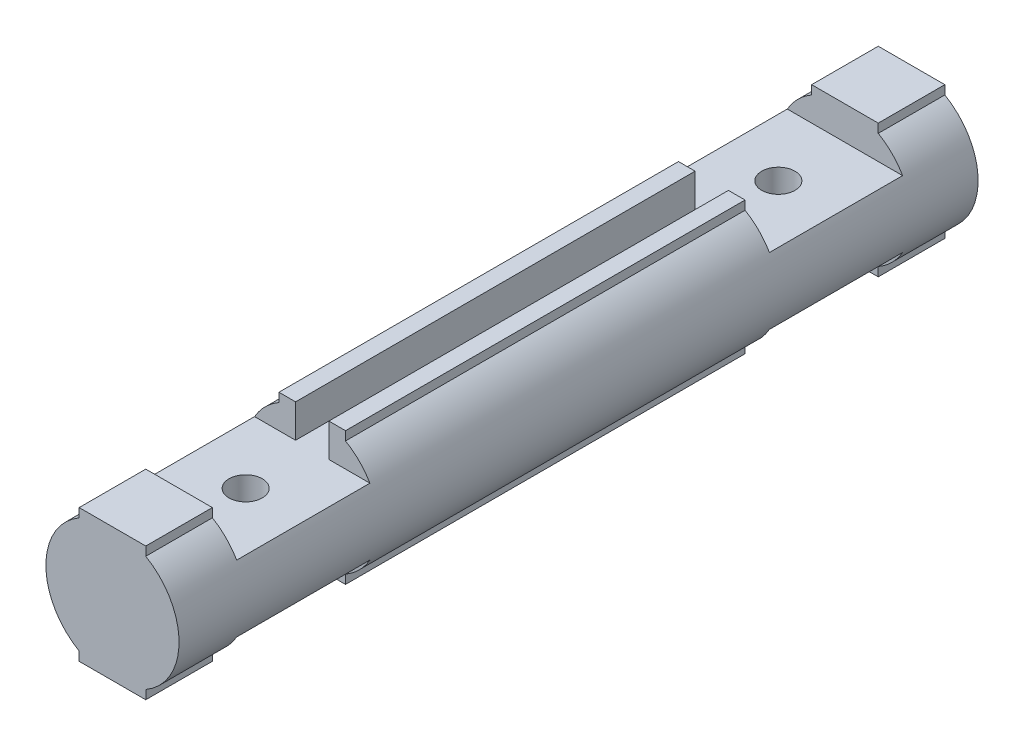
ISO-10303-21;
HEADER;
FILE_DESCRIPTION(('STEP AP214'),'2;1');
FILE_NAME('part.step','',(''),(''),'','','');
FILE_SCHEMA(('AUTOMOTIVE_DESIGN { 1 0 10303 214 1 1 1 1 }'));
ENDSEC;
DATA;
#1=APPLICATION_CONTEXT('core data for automotive mechanical design processes');
#2=APPLICATION_PROTOCOL_DEFINITION('international standard','automotive_design',2000,#1);
#3=PRODUCT_CONTEXT('',#1,'mechanical');
#4=PRODUCT('Part','Part','',(#3));
#5=PRODUCT_RELATED_PRODUCT_CATEGORY('part','',(#4));
#6=PRODUCT_DEFINITION_FORMATION('','',#4);
#7=PRODUCT_DEFINITION_CONTEXT('part definition',#1,'design');
#8=PRODUCT_DEFINITION('design','',#6,#7);
#9=PRODUCT_DEFINITION_SHAPE('','',#8);
#10=(LENGTH_UNIT() NAMED_UNIT(*) SI_UNIT(.MILLI.,.METRE.));
#11=(NAMED_UNIT(*) PLANE_ANGLE_UNIT() SI_UNIT($,.RADIAN.));
#12=(NAMED_UNIT(*) SI_UNIT($,.STERADIAN.) SOLID_ANGLE_UNIT());
#13=UNCERTAINTY_MEASURE_WITH_UNIT(LENGTH_MEASURE(1.E-05),#10,'distance_accuracy_value','');
#14=(GEOMETRIC_REPRESENTATION_CONTEXT(3) GLOBAL_UNCERTAINTY_ASSIGNED_CONTEXT((#13)) GLOBAL_UNIT_ASSIGNED_CONTEXT((#10,
#11,#12)) REPRESENTATION_CONTEXT('',''));
#15=CARTESIAN_POINT('',(0.,0.,0.));
#16=DIRECTION('',(0.,0.,1.));
#17=DIRECTION('',(1.,0.,0.));
#18=AXIS2_PLACEMENT_3D('',#15,#16,#17);
#19=CARTESIAN_POINT('',(5.,-10.,-82.3606797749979));
#20=DIRECTION('',(0.,-1.,0.));
#21=DIRECTION('',(0.,0.,-1.));
#22=AXIS2_PLACEMENT_3D('',#19,#20,#21);
#23=PLANE('',#22);
#24=DIRECTION('',(-1.,0.,0.));
#25=VECTOR('',#24,1.);
#26=CARTESIAN_POINT('',(8.66025403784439,-10.,-30.));
#27=LINE('',#26,#25);
#28=CARTESIAN_POINT('',(-2.5,-10.,-30.));
#29=VERTEX_POINT('',#28);
#30=CARTESIAN_POINT('',(-5.,-10.,-30.));
#31=VERTEX_POINT('',#30);
#32=EDGE_CURVE('E321',#29,#31,#27,.T.);
#33=ORIENTED_EDGE('',*,*,#32,.F.);
#34=DIRECTION('',(0.,0.,1.));
#35=VECTOR('',#34,1.);
#36=CARTESIAN_POINT('',(-2.5,-10.,30.));
#37=LINE('',#36,#35);
#38=CARTESIAN_POINT('',(-2.5,-10.,30.));
#39=VERTEX_POINT('',#38);
#40=EDGE_CURVE('E681',#29,#39,#37,.T.);
#41=ORIENTED_EDGE('',*,*,#40,.T.);
#42=DIRECTION('',(-1.,0.,0.));
#43=VECTOR('',#42,1.);
#44=CARTESIAN_POINT('',(8.66025403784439,-10.,30.));
#45=LINE('',#44,#43);
#46=CARTESIAN_POINT('',(-5.,-10.,30.));
#47=VERTEX_POINT('',#46);
#48=EDGE_CURVE('E536',#39,#47,#45,.T.);
#49=ORIENTED_EDGE('',*,*,#48,.T.);
#50=DIRECTION('',(0.,0.,1.));
#51=VECTOR('',#50,1.);
#52=CARTESIAN_POINT('',(-5.,-10.,-82.3606797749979));
#53=LINE('',#52,#51);
#54=EDGE_CURVE('E483',#31,#47,#53,.T.);
#55=ORIENTED_EDGE('',*,*,#54,.F.);
#56=EDGE_LOOP('',(#33,#41,#49,#55));
#57=FACE_BOUND('',#56,.T.);
#58=ADVANCED_FACE('F33',(#57),#23,.T.);
#59=CARTESIAN_POINT('',(5.,-10.,30.));
#60=VERTEX_POINT('',#59);
#61=CARTESIAN_POINT('',(2.5,-10.,30.));
#62=VERTEX_POINT('',#61);
#63=EDGE_CURVE('E568',#60,#62,#45,.T.);
#64=ORIENTED_EDGE('',*,*,#63,.T.);
#65=DIRECTION('',(0.,0.,-1.));
#66=VECTOR('',#65,1.);
#67=CARTESIAN_POINT('',(2.5,-10.,30.));
#68=LINE('',#67,#66);
#69=CARTESIAN_POINT('',(2.5,-10.,-30.));
#70=VERTEX_POINT('',#69);
#71=EDGE_CURVE('E308',#62,#70,#68,.T.);
#72=ORIENTED_EDGE('',*,*,#71,.T.);
#73=CARTESIAN_POINT('',(5.,-10.,-30.));
#74=VERTEX_POINT('',#73);
#75=EDGE_CURVE('E307',#74,#70,#27,.T.);
#76=ORIENTED_EDGE('',*,*,#75,.F.);
#77=DIRECTION('',(0.,0.,1.));
#78=VECTOR('',#77,1.);
#79=CARTESIAN_POINT('',(5.,-10.,-82.3606797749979));
#80=LINE('',#79,#78);
#81=EDGE_CURVE('E478',#74,#60,#80,.T.);
#82=ORIENTED_EDGE('',*,*,#81,.T.);
#83=EDGE_LOOP('',(#64,#72,#76,#82));
#84=FACE_BOUND('',#83,.T.);
#85=ADVANCED_FACE('F567',(#84),#23,.T.);
#86=CARTESIAN_POINT('',(0.,0.,-30.));
#87=DIRECTION('',(0.,0.,1.));
#88=DIRECTION('',(1.,0.,0.));
#89=AXIS2_PLACEMENT_3D('',#86,#87,#88);
#90=PLANE('',#89);
#91=DIRECTION('',(0.,-1.,0.));
#92=VECTOR('',#91,1.);
#93=CARTESIAN_POINT('',(-2.5,65.2079728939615,-30.));
#94=LINE('',#93,#92);
#95=CARTESIAN_POINT('',(-2.5,-5.,-30.));
#96=VERTEX_POINT('',#95);
#97=EDGE_CURVE('E683',#96,#29,#94,.T.);
#98=ORIENTED_EDGE('',*,*,#97,.T.);
#99=ORIENTED_EDGE('',*,*,#32,.T.);
#100=DIRECTION('',(0.,1.,0.));
#101=VECTOR('',#100,1.);
#102=CARTESIAN_POINT('',(-5.,-10.,-30.));
#103=LINE('',#102,#101);
#104=CARTESIAN_POINT('',(-5.,-8.66025403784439,-30.));
#105=VERTEX_POINT('',#104);
#106=EDGE_CURVE('E522',#31,#105,#103,.T.);
#107=ORIENTED_EDGE('',*,*,#106,.T.);
#108=CARTESIAN_POINT('',(0.,0.,-30.));
#109=DIRECTION('',(0.,0.,1.));
#110=DIRECTION('',(1.,0.,0.));
#111=AXIS2_PLACEMENT_3D('',#108,#109,#110);
#112=CIRCLE('',#111,10.);
#113=CARTESIAN_POINT('',(-8.66025403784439,-5.,-30.));
#114=VERTEX_POINT('',#113);
#115=EDGE_CURVE('E331',#114,#105,#112,.T.);
#116=ORIENTED_EDGE('',*,*,#115,.F.);
#117=DIRECTION('',(1.,0.,0.));
#118=VECTOR('',#117,1.);
#119=CARTESIAN_POINT('',(8.66025403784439,-5.,-30.));
#120=LINE('',#119,#118);
#121=EDGE_CURVE('E317',#114,#96,#120,.T.);
#122=ORIENTED_EDGE('',*,*,#121,.T.);
#123=EDGE_LOOP('',(#98,#99,#107,#116,#122));
#124=FACE_BOUND('',#123,.T.);
#125=ADVANCED_FACE('F671',(#124),#90,.F.);
#126=DIRECTION('',(0.,-1.,0.));
#127=VECTOR('',#126,1.);
#128=CARTESIAN_POINT('',(2.5,65.2079728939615,-30.));
#129=LINE('',#128,#127);
#130=CARTESIAN_POINT('',(2.5,-4.99999999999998,-30.));
#131=VERTEX_POINT('',#130);
#132=EDGE_CURVE('E292',#131,#70,#129,.T.);
#133=ORIENTED_EDGE('',*,*,#132,.F.);
#134=CARTESIAN_POINT('',(8.66025403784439,-5.,-30.));
#135=VERTEX_POINT('',#134);
#136=EDGE_CURVE('E304',#131,#135,#120,.T.);
#137=ORIENTED_EDGE('',*,*,#136,.T.);
#138=CARTESIAN_POINT('',(0.,0.,-30.));
#139=DIRECTION('',(0.,0.,1.));
#140=DIRECTION('',(1.,0.,0.));
#141=AXIS2_PLACEMENT_3D('',#138,#139,#140);
#142=CIRCLE('',#141,10.);
#143=CARTESIAN_POINT('',(5.,-8.66025403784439,-30.));
#144=VERTEX_POINT('',#143);
#145=EDGE_CURVE('E336',#144,#135,#142,.T.);
#146=ORIENTED_EDGE('',*,*,#145,.F.);
#147=DIRECTION('',(0.,-1.,0.));
#148=VECTOR('',#147,1.);
#149=CARTESIAN_POINT('',(5.,-10.,-30.));
#150=LINE('',#149,#148);
#151=EDGE_CURVE('E334',#144,#74,#150,.T.);
#152=ORIENTED_EDGE('',*,*,#151,.T.);
#153=ORIENTED_EDGE('',*,*,#75,.T.);
#154=EDGE_LOOP('',(#133,#137,#146,#152,#153));
#155=FACE_BOUND('',#154,.T.);
#156=ADVANCED_FACE('F302',(#155),#90,.F.);
#157=CARTESIAN_POINT('',(0.,0.,30.));
#158=DIRECTION('',(0.,0.,-1.));
#159=DIRECTION('',(1.,0.,0.));
#160=AXIS2_PLACEMENT_3D('',#157,#158,#159);
#161=PLANE('',#160);
#162=DIRECTION('',(0.,-1.,0.));
#163=VECTOR('',#162,1.);
#164=CARTESIAN_POINT('',(-2.5,65.2079728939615,30.));
#165=LINE('',#164,#163);
#166=CARTESIAN_POINT('',(-2.5,-4.99999999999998,30.));
#167=VERTEX_POINT('',#166);
#168=EDGE_CURVE('E679',#167,#39,#165,.T.);
#169=ORIENTED_EDGE('',*,*,#168,.F.);
#170=DIRECTION('',(1.,0.,0.));
#171=VECTOR('',#170,1.);
#172=CARTESIAN_POINT('',(8.66025403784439,-5.,30.));
#173=LINE('',#172,#171);
#174=CARTESIAN_POINT('',(-8.66025403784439,-5.,30.));
#175=VERTEX_POINT('',#174);
#176=EDGE_CURVE('E674',#175,#167,#173,.T.);
#177=ORIENTED_EDGE('',*,*,#176,.F.);
#178=CARTESIAN_POINT('',(0.,0.,30.));
#179=DIRECTION('',(0.,0.,-1.));
#180=DIRECTION('',(-1.,0.,0.));
#181=AXIS2_PLACEMENT_3D('',#178,#179,#180);
#182=CIRCLE('',#181,10.);
#183=CARTESIAN_POINT('',(-5.,-8.66025403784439,30.));
#184=VERTEX_POINT('',#183);
#185=EDGE_CURVE('E56',#184,#175,#182,.T.);
#186=ORIENTED_EDGE('',*,*,#185,.F.);
#187=DIRECTION('',(0.,-1.,0.));
#188=VECTOR('',#187,1.);
#189=CARTESIAN_POINT('',(-5.,-10.,30.));
#190=LINE('',#189,#188);
#191=EDGE_CURVE('E41',#184,#47,#190,.T.);
#192=ORIENTED_EDGE('',*,*,#191,.T.);
#193=ORIENTED_EDGE('',*,*,#48,.F.);
#194=EDGE_LOOP('',(#169,#177,#186,#192,#193));
#195=FACE_BOUND('',#194,.T.);
#196=ADVANCED_FACE('F535',(#195),#161,.F.);
#197=DIRECTION('',(0.,-1.,0.));
#198=VECTOR('',#197,1.);
#199=CARTESIAN_POINT('',(2.5,65.2079728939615,30.));
#200=LINE('',#199,#198);
#201=CARTESIAN_POINT('',(2.5,-5.,30.));
#202=VERTEX_POINT('',#201);
#203=EDGE_CURVE('E48',#202,#62,#200,.T.);
#204=ORIENTED_EDGE('',*,*,#203,.T.);
#205=ORIENTED_EDGE('',*,*,#63,.F.);
#206=DIRECTION('',(0.,1.,0.));
#207=VECTOR('',#206,1.);
#208=CARTESIAN_POINT('',(5.,-10.,30.));
#209=LINE('',#208,#207);
#210=CARTESIAN_POINT('',(5.,-8.66025403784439,30.));
#211=VERTEX_POINT('',#210);
#212=EDGE_CURVE('E574',#60,#211,#209,.T.);
#213=ORIENTED_EDGE('',*,*,#212,.T.);
#214=CARTESIAN_POINT('',(0.,0.,30.));
#215=DIRECTION('',(0.,0.,-1.));
#216=DIRECTION('',(-1.,0.,0.));
#217=AXIS2_PLACEMENT_3D('',#214,#215,#216);
#218=CIRCLE('',#217,10.);
#219=CARTESIAN_POINT('',(8.66025403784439,-5.,30.));
#220=VERTEX_POINT('',#219);
#221=EDGE_CURVE('E578',#220,#211,#218,.T.);
#222=ORIENTED_EDGE('',*,*,#221,.F.);
#223=EDGE_CURVE('E297',#202,#220,#173,.T.);
#224=ORIENTED_EDGE('',*,*,#223,.F.);
#225=EDGE_LOOP('',(#204,#205,#213,#222,#224));
#226=FACE_BOUND('',#225,.T.);
#227=ADVANCED_FACE('F696',(#226),#161,.F.);
#228=CARTESIAN_POINT('',(0.,0.,60.));
#229=DIRECTION('',(0.,0.,-1.));
#230=DIRECTION('',(-1.,0.,0.));
#231=AXIS2_PLACEMENT_3D('',#228,#229,#230);
#232=CYLINDRICAL_SURFACE('',#231,10.);
#233=CARTESIAN_POINT('',(0.,0.,50.));
#234=DIRECTION('',(0.,0.,-1.));
#235=DIRECTION('',(-1.,0.,0.));
#236=AXIS2_PLACEMENT_3D('',#233,#234,#235);
#237=CIRCLE('',#236,10.);
#238=CARTESIAN_POINT('',(-5.,-8.66025403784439,50.));
#239=VERTEX_POINT('',#238);
#240=CARTESIAN_POINT('',(-8.66025403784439,-5.,50.));
#241=VERTEX_POINT('',#240);
#242=EDGE_CURVE('E580',#239,#241,#237,.T.);
#243=ORIENTED_EDGE('',*,*,#242,.F.);
#244=DIRECTION('',(0.,0.,-1.));
#245=VECTOR('',#244,1.);
#246=CARTESIAN_POINT('',(-5.,-8.66025403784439,60.));
#247=LINE('',#246,#245);
#248=CARTESIAN_POINT('',(-5.,-8.66025403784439,60.));
#249=VERTEX_POINT('',#248);
#250=EDGE_CURVE('E494',#239,#249,#247,.F.);
#251=ORIENTED_EDGE('',*,*,#250,.T.);
#252=CARTESIAN_POINT('',(0.,0.,60.));
#253=DIRECTION('',(0.,0.,1.));
#254=DIRECTION('',(1.,0.,0.));
#255=AXIS2_PLACEMENT_3D('',#252,#253,#254);
#256=CIRCLE('',#255,10.);
#257=CARTESIAN_POINT('',(-5.,8.66025403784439,60.));
#258=VERTEX_POINT('',#257);
#259=EDGE_CURVE('E509',#258,#249,#256,.T.);
#260=ORIENTED_EDGE('',*,*,#259,.F.);
#261=DIRECTION('',(0.,0.,-1.));
#262=VECTOR('',#261,1.);
#263=CARTESIAN_POINT('',(-5.,8.66025403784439,60.));
#264=LINE('',#263,#262);
#265=CARTESIAN_POINT('',(-5.,8.66025403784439,50.));
#266=VERTEX_POINT('',#265);
#267=EDGE_CURVE('E501',#258,#266,#264,.T.);
#268=ORIENTED_EDGE('',*,*,#267,.T.);
#269=CARTESIAN_POINT('',(0.,0.,50.));
#270=DIRECTION('',(0.,0.,-1.));
#271=DIRECTION('',(-1.,0.,0.));
#272=AXIS2_PLACEMENT_3D('',#269,#270,#271);
#273=CIRCLE('',#272,10.);
#274=CARTESIAN_POINT('',(-8.66025403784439,5.,50.));
#275=VERTEX_POINT('',#274);
#276=EDGE_CURVE('E400',#275,#266,#273,.T.);
#277=ORIENTED_EDGE('',*,*,#276,.F.);
#278=DIRECTION('',(0.,0.,-1.));
#279=VECTOR('',#278,1.);
#280=CARTESIAN_POINT('',(-8.66025403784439,5.,50.));
#281=LINE('',#280,#279);
#282=CARTESIAN_POINT('',(-8.66025403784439,5.,30.));
#283=VERTEX_POINT('',#282);
#284=EDGE_CURVE('E382',#275,#283,#281,.T.);
#285=ORIENTED_EDGE('',*,*,#284,.T.);
#286=CARTESIAN_POINT('',(0.,0.,30.));
#287=DIRECTION('',(0.,0.,-1.));
#288=DIRECTION('',(-1.,0.,0.));
#289=AXIS2_PLACEMENT_3D('',#286,#287,#288);
#290=CIRCLE('',#289,10.);
#291=CARTESIAN_POINT('',(-5.,8.66025403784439,30.));
#292=VERTEX_POINT('',#291);
#293=EDGE_CURVE('E392',#283,#292,#290,.T.);
#294=ORIENTED_EDGE('',*,*,#293,.T.);
#295=CARTESIAN_POINT('',(-5.,8.66025403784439,-30.));
#296=VERTEX_POINT('',#295);
#297=EDGE_CURVE('E505',#292,#296,#264,.T.);
#298=ORIENTED_EDGE('',*,*,#297,.T.);
#299=CARTESIAN_POINT('',(0.,0.,-30.));
#300=DIRECTION('',(0.,0.,1.));
#301=DIRECTION('',(1.,0.,0.));
#302=AXIS2_PLACEMENT_3D('',#299,#300,#301);
#303=CIRCLE('',#302,10.);
#304=CARTESIAN_POINT('',(-8.66025403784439,5.,-30.));
#305=VERTEX_POINT('',#304);
#306=EDGE_CURVE('E429',#296,#305,#303,.T.);
#307=ORIENTED_EDGE('',*,*,#306,.T.);
#308=DIRECTION('',(0.,0.,1.));
#309=VECTOR('',#308,1.);
#310=CARTESIAN_POINT('',(-8.66025403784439,5.,-50.));
#311=LINE('',#310,#309);
#312=CARTESIAN_POINT('',(-8.66025403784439,5.,-50.));
#313=VERTEX_POINT('',#312);
#314=EDGE_CURVE('E412',#313,#305,#311,.T.);
#315=ORIENTED_EDGE('',*,*,#314,.F.);
#316=CARTESIAN_POINT('',(0.,0.,-50.));
#317=DIRECTION('',(0.,0.,1.));
#318=DIRECTION('',(1.,0.,0.));
#319=AXIS2_PLACEMENT_3D('',#316,#317,#318);
#320=CIRCLE('',#319,10.);
#321=CARTESIAN_POINT('',(-5.,8.66025403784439,-50.));
#322=VERTEX_POINT('',#321);
#323=EDGE_CURVE('E437',#322,#313,#320,.T.);
#324=ORIENTED_EDGE('',*,*,#323,.F.);
#325=CARTESIAN_POINT('',(-5.,8.66025403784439,-60.));
#326=VERTEX_POINT('',#325);
#327=EDGE_CURVE('E499',#322,#326,#264,.T.);
#328=ORIENTED_EDGE('',*,*,#327,.T.);
#329=CARTESIAN_POINT('',(0.,0.,-60.));
#330=DIRECTION('',(0.,0.,1.));
#331=DIRECTION('',(1.,0.,0.));
#332=AXIS2_PLACEMENT_3D('',#329,#330,#331);
#333=CIRCLE('',#332,10.);
#334=CARTESIAN_POINT('',(-5.,-8.66025403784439,-60.));
#335=VERTEX_POINT('',#334);
#336=EDGE_CURVE('E510',#326,#335,#333,.T.);
#337=ORIENTED_EDGE('',*,*,#336,.T.);
#338=CARTESIAN_POINT('',(-5.,-8.66025403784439,-50.));
#339=VERTEX_POINT('',#338);
#340=EDGE_CURVE('E496',#335,#339,#247,.F.);
#341=ORIENTED_EDGE('',*,*,#340,.T.);
#342=CARTESIAN_POINT('',(0.,0.,-50.));
#343=DIRECTION('',(0.,0.,1.));
#344=DIRECTION('',(1.,0.,0.));
#345=AXIS2_PLACEMENT_3D('',#342,#343,#344);
#346=CIRCLE('',#345,10.);
#347=CARTESIAN_POINT('',(-8.66025403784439,-5.,-50.));
#348=VERTEX_POINT('',#347);
#349=EDGE_CURVE('E338',#348,#339,#346,.T.);
#350=ORIENTED_EDGE('',*,*,#349,.F.);
#351=DIRECTION('',(0.,0.,1.));
#352=VECTOR('',#351,1.);
#353=CARTESIAN_POINT('',(-8.66025403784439,-5.,-50.));
#354=LINE('',#353,#352);
#355=EDGE_CURVE('E325',#348,#114,#354,.T.);
#356=ORIENTED_EDGE('',*,*,#355,.T.);
#357=ORIENTED_EDGE('',*,*,#115,.T.);
#358=EDGE_CURVE('E500',#105,#184,#247,.F.);
#359=ORIENTED_EDGE('',*,*,#358,.T.);
#360=ORIENTED_EDGE('',*,*,#185,.T.);
#361=DIRECTION('',(0.,0.,-1.));
#362=VECTOR('',#361,1.);
#363=CARTESIAN_POINT('',(-8.66025403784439,-5.,50.));
#364=LINE('',#363,#362);
#365=EDGE_CURVE('E689',#241,#175,#364,.T.);
#366=ORIENTED_EDGE('',*,*,#365,.F.);
#367=EDGE_LOOP('',(#243,#251,#260,#268,#277,#285,#294,#298,#307,#315,#324,#328,#337,#341,#350,
#356,#357,#359,#360,#366));
#368=FACE_BOUND('',#367,.T.);
#369=ADVANCED_FACE('F35',(#368),#232,.T.);
#370=CARTESIAN_POINT('',(0.,0.,50.));
#371=DIRECTION('',(0.,0.,-1.));
#372=DIRECTION('',(-1.,0.,0.));
#373=AXIS2_PLACEMENT_3D('',#370,#371,#372);
#374=CIRCLE('',#373,10.);
#375=CARTESIAN_POINT('',(8.66025403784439,-5.,50.));
#376=VERTEX_POINT('',#375);
#377=CARTESIAN_POINT('',(5.,-8.66025403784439,50.));
#378=VERTEX_POINT('',#377);
#379=EDGE_CURVE('E588',#376,#378,#374,.T.);
#380=ORIENTED_EDGE('',*,*,#379,.F.);
#381=DIRECTION('',(0.,0.,-1.));
#382=VECTOR('',#381,1.);
#383=CARTESIAN_POINT('',(8.66025403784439,-5.,50.));
#384=LINE('',#383,#382);
#385=EDGE_CURVE('E531',#376,#220,#384,.T.);
#386=ORIENTED_EDGE('',*,*,#385,.T.);
#387=ORIENTED_EDGE('',*,*,#221,.T.);
#388=DIRECTION('',(0.,0.,-1.));
#389=VECTOR('',#388,1.);
#390=CARTESIAN_POINT('',(5.,-8.66025403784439,60.));
#391=LINE('',#390,#389);
#392=EDGE_CURVE('E495',#211,#144,#391,.T.);
#393=ORIENTED_EDGE('',*,*,#392,.T.);
#394=ORIENTED_EDGE('',*,*,#145,.T.);
#395=DIRECTION('',(0.,0.,1.));
#396=VECTOR('',#395,1.);
#397=CARTESIAN_POINT('',(8.66025403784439,-5.,-50.));
#398=LINE('',#397,#396);
#399=CARTESIAN_POINT('',(8.66025403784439,-5.,-50.));
#400=VERTEX_POINT('',#399);
#401=EDGE_CURVE('E315',#400,#135,#398,.T.);
#402=ORIENTED_EDGE('',*,*,#401,.F.);
#403=CARTESIAN_POINT('',(0.,0.,-50.));
#404=DIRECTION('',(0.,0.,1.));
#405=DIRECTION('',(1.,0.,0.));
#406=AXIS2_PLACEMENT_3D('',#403,#404,#405);
#407=CIRCLE('',#406,10.);
#408=CARTESIAN_POINT('',(5.,-8.66025403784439,-50.));
#409=VERTEX_POINT('',#408);
#410=EDGE_CURVE('E343',#409,#400,#407,.T.);
#411=ORIENTED_EDGE('',*,*,#410,.F.);
#412=CARTESIAN_POINT('',(5.,-8.66025403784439,-60.));
#413=VERTEX_POINT('',#412);
#414=EDGE_CURVE('E489',#409,#413,#391,.T.);
#415=ORIENTED_EDGE('',*,*,#414,.T.);
#416=CARTESIAN_POINT('',(5.,8.66025403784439,-60.));
#417=VERTEX_POINT('',#416);
#418=EDGE_CURVE('E504',#413,#417,#333,.T.);
#419=ORIENTED_EDGE('',*,*,#418,.T.);
#420=DIRECTION('',(0.,0.,-1.));
#421=VECTOR('',#420,1.);
#422=CARTESIAN_POINT('',(5.,8.66025403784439,60.));
#423=LINE('',#422,#421);
#424=CARTESIAN_POINT('',(5.,8.66025403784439,-50.));
#425=VERTEX_POINT('',#424);
#426=EDGE_CURVE('E486',#417,#425,#423,.F.);
#427=ORIENTED_EDGE('',*,*,#426,.T.);
#428=CARTESIAN_POINT('',(0.,0.,-50.));
#429=DIRECTION('',(0.,0.,1.));
#430=DIRECTION('',(1.,0.,0.));
#431=AXIS2_PLACEMENT_3D('',#428,#429,#430);
#432=CIRCLE('',#431,10.);
#433=CARTESIAN_POINT('',(8.66025403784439,5.,-50.));
#434=VERTEX_POINT('',#433);
#435=EDGE_CURVE('E432',#434,#425,#432,.T.);
#436=ORIENTED_EDGE('',*,*,#435,.F.);
#437=DIRECTION('',(0.,0.,1.));
#438=VECTOR('',#437,1.);
#439=CARTESIAN_POINT('',(8.66025403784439,5.,-50.));
#440=LINE('',#439,#438);
#441=CARTESIAN_POINT('',(8.66025403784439,5.,-30.));
#442=VERTEX_POINT('',#441);
#443=EDGE_CURVE('E419',#434,#442,#440,.T.);
#444=ORIENTED_EDGE('',*,*,#443,.T.);
#445=CARTESIAN_POINT('',(0.,0.,-30.));
#446=DIRECTION('',(0.,0.,1.));
#447=DIRECTION('',(1.,0.,0.));
#448=AXIS2_PLACEMENT_3D('',#445,#446,#447);
#449=CIRCLE('',#448,10.);
#450=CARTESIAN_POINT('',(5.,8.66025403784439,-30.));
#451=VERTEX_POINT('',#450);
#452=EDGE_CURVE('E422',#442,#451,#449,.T.);
#453=ORIENTED_EDGE('',*,*,#452,.T.);
#454=CARTESIAN_POINT('',(5.,8.66025403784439,30.));
#455=VERTEX_POINT('',#454);
#456=EDGE_CURVE('E490',#451,#455,#423,.F.);
#457=ORIENTED_EDGE('',*,*,#456,.T.);
#458=CARTESIAN_POINT('',(0.,0.,30.));
#459=DIRECTION('',(0.,0.,-1.));
#460=DIRECTION('',(-1.,0.,0.));
#461=AXIS2_PLACEMENT_3D('',#458,#459,#460);
#462=CIRCLE('',#461,10.);
#463=CARTESIAN_POINT('',(8.66025403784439,5.,30.));
#464=VERTEX_POINT('',#463);
#465=EDGE_CURVE('E385',#455,#464,#462,.T.);
#466=ORIENTED_EDGE('',*,*,#465,.T.);
#467=DIRECTION('',(0.,0.,-1.));
#468=VECTOR('',#467,1.);
#469=CARTESIAN_POINT('',(8.66025403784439,5.,50.));
#470=LINE('',#469,#468);
#471=CARTESIAN_POINT('',(8.66025403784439,5.,50.));
#472=VERTEX_POINT('',#471);
#473=EDGE_CURVE('E375',#472,#464,#470,.T.);
#474=ORIENTED_EDGE('',*,*,#473,.F.);
#475=CARTESIAN_POINT('',(0.,0.,50.));
#476=DIRECTION('',(0.,0.,-1.));
#477=DIRECTION('',(-1.,0.,0.));
#478=AXIS2_PLACEMENT_3D('',#475,#476,#477);
#479=CIRCLE('',#478,10.);
#480=CARTESIAN_POINT('',(5.,8.66025403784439,50.));
#481=VERTEX_POINT('',#480);
#482=EDGE_CURVE('E395',#481,#472,#479,.T.);
#483=ORIENTED_EDGE('',*,*,#482,.F.);
#484=CARTESIAN_POINT('',(5.,8.66025403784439,60.));
#485=VERTEX_POINT('',#484);
#486=EDGE_CURVE('E485',#481,#485,#423,.F.);
#487=ORIENTED_EDGE('',*,*,#486,.T.);
#488=CARTESIAN_POINT('',(5.,-8.66025403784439,60.));
#489=VERTEX_POINT('',#488);
#490=EDGE_CURVE('E506',#489,#485,#256,.T.);
#491=ORIENTED_EDGE('',*,*,#490,.F.);
#492=EDGE_CURVE('E491',#489,#378,#391,.T.);
#493=ORIENTED_EDGE('',*,*,#492,.T.);
#494=EDGE_LOOP('',(#380,#386,#387,#393,#394,#402,#411,#415,#419,#427,#436,#444,#453,#457,#466,
#474,#483,#487,#491,#493));
#495=FACE_BOUND('',#494,.T.);
#496=ADVANCED_FACE('F597',(#495),#232,.T.);
#497=CARTESIAN_POINT('',(-5.,-10.,50.));
#498=VERTEX_POINT('',#497);
#499=CARTESIAN_POINT('',(-5.,-10.,60.));
#500=VERTEX_POINT('',#499);
#501=EDGE_CURVE('E464',#498,#500,#53,.T.);
#502=ORIENTED_EDGE('',*,*,#501,.F.);
#503=DIRECTION('',(-1.,0.,0.));
#504=VECTOR('',#503,1.);
#505=CARTESIAN_POINT('',(8.66025403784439,-10.,50.));
#506=LINE('',#505,#504);
#507=CARTESIAN_POINT('',(5.,-10.,50.));
#508=VERTEX_POINT('',#507);
#509=EDGE_CURVE('E560',#508,#498,#506,.T.);
#510=ORIENTED_EDGE('',*,*,#509,.F.);
#511=CARTESIAN_POINT('',(5.,-10.,60.));
#512=VERTEX_POINT('',#511);
#513=EDGE_CURVE('E479',#508,#512,#80,.T.);
#514=ORIENTED_EDGE('',*,*,#513,.T.);
#515=DIRECTION('',(1.,0.,0.));
#516=VECTOR('',#515,1.);
#517=CARTESIAN_POINT('',(5.,-10.,60.));
#518=LINE('',#517,#516);
#519=EDGE_CURVE('E454',#500,#512,#518,.T.);
#520=ORIENTED_EDGE('',*,*,#519,.F.);
#521=EDGE_LOOP('',(#502,#510,#514,#520));
#522=FACE_BOUND('',#521,.T.);
#523=ADVANCED_FACE('F558',(#522),#23,.T.);
#524=CARTESIAN_POINT('',(5.,-10.,-82.3606797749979));
#525=DIRECTION('',(1.,0.,0.));
#526=DIRECTION('',(0.,0.,-1.));
#527=AXIS2_PLACEMENT_3D('',#524,#525,#526);
#528=PLANE('',#527);
#529=ORIENTED_EDGE('',*,*,#513,.F.);
#530=DIRECTION('',(0.,1.,0.));
#531=VECTOR('',#530,1.);
#532=CARTESIAN_POINT('',(5.,-10.,50.));
#533=LINE('',#532,#531);
#534=EDGE_CURVE('E586',#508,#378,#533,.T.);
#535=ORIENTED_EDGE('',*,*,#534,.T.);
#536=ORIENTED_EDGE('',*,*,#492,.F.);
#537=DIRECTION('',(0.,1.,0.));
#538=VECTOR('',#537,1.);
#539=CARTESIAN_POINT('',(5.,-10.,60.));
#540=LINE('',#539,#538);
#541=EDGE_CURVE('E458',#512,#489,#540,.T.);
#542=ORIENTED_EDGE('',*,*,#541,.F.);
#543=EDGE_LOOP('',(#529,#535,#536,#542));
#544=FACE_BOUND('',#543,.T.);
#545=ADVANCED_FACE('F700',(#544),#528,.T.);
#546=CARTESIAN_POINT('',(-5.,-10.,-82.3606797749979));
#547=DIRECTION('',(-1.,0.,0.));
#548=DIRECTION('',(0.,0.,1.));
#549=AXIS2_PLACEMENT_3D('',#546,#547,#548);
#550=PLANE('',#549);
#551=ORIENTED_EDGE('',*,*,#250,.F.);
#552=DIRECTION('',(0.,-1.,0.));
#553=VECTOR('',#552,1.);
#554=CARTESIAN_POINT('',(-5.,-10.,50.));
#555=LINE('',#554,#553);
#556=EDGE_CURVE('E12',#239,#498,#555,.T.);
#557=ORIENTED_EDGE('',*,*,#556,.T.);
#558=ORIENTED_EDGE('',*,*,#501,.T.);
#559=DIRECTION('',(0.,-1.,0.));
#560=VECTOR('',#559,1.);
#561=CARTESIAN_POINT('',(-5.,-10.,60.));
#562=LINE('',#561,#560);
#563=EDGE_CURVE('E439',#249,#500,#562,.T.);
#564=ORIENTED_EDGE('',*,*,#563,.F.);
#565=EDGE_LOOP('',(#551,#557,#558,#564));
#566=FACE_BOUND('',#565,.T.);
#567=ADVANCED_FACE('F550',(#566),#550,.T.);
#568=CARTESIAN_POINT('',(5.,-10.,-60.));
#569=VERTEX_POINT('',#568);
#570=CARTESIAN_POINT('',(5.,-10.,-50.));
#571=VERTEX_POINT('',#570);
#572=EDGE_CURVE('E475',#569,#571,#80,.T.);
#573=ORIENTED_EDGE('',*,*,#572,.T.);
#574=DIRECTION('',(-1.,0.,0.));
#575=VECTOR('',#574,1.);
#576=CARTESIAN_POINT('',(8.66025403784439,-10.,-50.));
#577=LINE('',#576,#575);
#578=CARTESIAN_POINT('',(-5.,-10.,-50.));
#579=VERTEX_POINT('',#578);
#580=EDGE_CURVE('E320',#571,#579,#577,.T.);
#581=ORIENTED_EDGE('',*,*,#580,.T.);
#582=CARTESIAN_POINT('',(-5.,-10.,-60.));
#583=VERTEX_POINT('',#582);
#584=EDGE_CURVE('E480',#583,#579,#53,.T.);
#585=ORIENTED_EDGE('',*,*,#584,.F.);
#586=DIRECTION('',(-1.,0.,0.));
#587=VECTOR('',#586,1.);
#588=CARTESIAN_POINT('',(5.,-10.,-60.));
#589=LINE('',#588,#587);
#590=EDGE_CURVE('E450',#569,#583,#589,.T.);
#591=ORIENTED_EDGE('',*,*,#590,.F.);
#592=EDGE_LOOP('',(#573,#581,#585,#591));
#593=FACE_BOUND('',#592,.T.);
#594=ADVANCED_FACE('F611',(#593),#23,.T.);
#595=ORIENTED_EDGE('',*,*,#414,.F.);
#596=DIRECTION('',(0.,-1.,0.));
#597=VECTOR('',#596,1.);
#598=CARTESIAN_POINT('',(5.,-10.,-50.));
#599=LINE('',#598,#597);
#600=EDGE_CURVE('E340',#409,#571,#599,.T.);
#601=ORIENTED_EDGE('',*,*,#600,.T.);
#602=ORIENTED_EDGE('',*,*,#572,.F.);
#603=DIRECTION('',(0.,-1.,0.));
#604=VECTOR('',#603,1.);
#605=CARTESIAN_POINT('',(5.,-10.,-60.));
#606=LINE('',#605,#604);
#607=EDGE_CURVE('E444',#413,#569,#606,.T.);
#608=ORIENTED_EDGE('',*,*,#607,.F.);
#609=EDGE_LOOP('',(#595,#601,#602,#608));
#610=FACE_BOUND('',#609,.T.);
#611=ADVANCED_FACE('F609',(#610),#528,.T.);
#612=ORIENTED_EDGE('',*,*,#584,.T.);
#613=DIRECTION('',(0.,1.,0.));
#614=VECTOR('',#613,1.);
#615=CARTESIAN_POINT('',(-5.,-10.,-50.));
#616=LINE('',#615,#614);
#617=EDGE_CURVE('E526',#579,#339,#616,.T.);
#618=ORIENTED_EDGE('',*,*,#617,.T.);
#619=ORIENTED_EDGE('',*,*,#340,.F.);
#620=DIRECTION('',(0.,1.,0.));
#621=VECTOR('',#620,1.);
#622=CARTESIAN_POINT('',(-5.,-10.,-60.));
#623=LINE('',#622,#621);
#624=EDGE_CURVE('E447',#583,#335,#623,.T.);
#625=ORIENTED_EDGE('',*,*,#624,.F.);
#626=EDGE_LOOP('',(#612,#618,#619,#625));
#627=FACE_BOUND('',#626,.T.);
#628=ADVANCED_FACE('F617',(#627),#550,.T.);
#629=CARTESIAN_POINT('',(0.,-10.,-40.));
#630=DIRECTION('',(0.,1.,0.));
#631=DIRECTION('',(0.,0.,1.));
#632=AXIS2_PLACEMENT_3D('',#629,#630,#631);
#633=CYLINDRICAL_SURFACE('',#632,2.5);
#634=CARTESIAN_POINT('',(0.,5.,-40.));
#635=DIRECTION('',(0.,1.,0.));
#636=DIRECTION('',(0.,0.,1.));
#637=AXIS2_PLACEMENT_3D('',#634,#635,#636);
#638=CIRCLE('',#637,2.5);
#639=CARTESIAN_POINT('',(0.,5.,-37.5));
#640=VERTEX_POINT('',#639);
#641=EDGE_CURVE('E402',#640,#640,#638,.T.);
#642=ORIENTED_EDGE('',*,*,#641,.T.);
#643=EDGE_LOOP('',(#642));
#644=FACE_BOUND('',#643,.T.);
#645=CARTESIAN_POINT('',(0.,-5.,-40.));
#646=DIRECTION('',(0.,-1.,0.));
#647=DIRECTION('',(0.,0.,-1.));
#648=AXIS2_PLACEMENT_3D('',#645,#646,#647);
#649=CIRCLE('',#648,2.5);
#650=CARTESIAN_POINT('',(0.,-5.,-42.5));
#651=VERTEX_POINT('',#650);
#652=EDGE_CURVE('E328',#651,#651,#649,.F.);
#653=ORIENTED_EDGE('',*,*,#652,.F.);
#654=EDGE_LOOP('',(#653));
#655=FACE_BOUND('',#654,.T.);
#656=ADVANCED_FACE('F849',(#644,#655),#633,.F.);
#657=CARTESIAN_POINT('',(5.,10.,-82.3606797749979));
#658=DIRECTION('',(0.,1.,0.));
#659=DIRECTION('',(0.,0.,1.));
#660=AXIS2_PLACEMENT_3D('',#657,#658,#659);
#661=PLANE('',#660);
#662=DIRECTION('',(0.,0.,-1.));
#663=VECTOR('',#662,1.);
#664=CARTESIAN_POINT('',(2.5,10.,30.));
#665=LINE('',#664,#663);
#666=CARTESIAN_POINT('',(2.5,10.,30.));
#667=VERTEX_POINT('',#666);
#668=CARTESIAN_POINT('',(2.5,10.,-30.));
#669=VERTEX_POINT('',#668);
#670=EDGE_CURVE('E346',#667,#669,#665,.T.);
#671=ORIENTED_EDGE('',*,*,#670,.F.);
#672=DIRECTION('',(-1.,0.,0.));
#673=VECTOR('',#672,1.);
#674=CARTESIAN_POINT('',(8.66025403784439,10.,30.));
#675=LINE('',#674,#673);
#676=CARTESIAN_POINT('',(5.,10.,30.));
#677=VERTEX_POINT('',#676);
#678=EDGE_CURVE('E376',#677,#667,#675,.T.);
#679=ORIENTED_EDGE('',*,*,#678,.F.);
#680=DIRECTION('',(0.,0.,1.));
#681=VECTOR('',#680,1.);
#682=CARTESIAN_POINT('',(5.,10.,-82.3606797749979));
#683=LINE('',#682,#681);
#684=CARTESIAN_POINT('',(5.,10.,-30.));
#685=VERTEX_POINT('',#684);
#686=EDGE_CURVE('E473',#685,#677,#683,.T.);
#687=ORIENTED_EDGE('',*,*,#686,.F.);
#688=DIRECTION('',(-1.,0.,0.));
#689=VECTOR('',#688,1.);
#690=CARTESIAN_POINT('',(8.66025403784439,10.,-30.));
#691=LINE('',#690,#689);
#692=EDGE_CURVE('E410',#685,#669,#691,.T.);
#693=ORIENTED_EDGE('',*,*,#692,.T.);
#694=EDGE_LOOP('',(#671,#679,#687,#693));
#695=FACE_BOUND('',#694,.T.);
#696=ADVANCED_FACE('F715',(#695),#661,.T.);
#697=CARTESIAN_POINT('',(0.,0.,-30.));
#698=DIRECTION('',(0.,0.,1.));
#699=DIRECTION('',(1.,0.,0.));
#700=AXIS2_PLACEMENT_3D('',#697,#698,#699);
#701=PLANE('',#700);
#702=DIRECTION('',(1.,0.,0.));
#703=VECTOR('',#702,1.);
#704=CARTESIAN_POINT('',(8.66025403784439,5.,-30.));
#705=LINE('',#704,#703);
#706=CARTESIAN_POINT('',(2.5,5.,-30.));
#707=VERTEX_POINT('',#706);
#708=EDGE_CURVE('E405',#707,#442,#705,.T.);
#709=ORIENTED_EDGE('',*,*,#708,.F.);
#710=DIRECTION('',(0.,1.,0.));
#711=VECTOR('',#710,1.);
#712=CARTESIAN_POINT('',(2.5,-55.2079728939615,-30.));
#713=LINE('',#712,#711);
#714=EDGE_CURVE('E357',#707,#669,#713,.T.);
#715=ORIENTED_EDGE('',*,*,#714,.T.);
#716=ORIENTED_EDGE('',*,*,#692,.F.);
#717=DIRECTION('',(0.,-1.,0.));
#718=VECTOR('',#717,1.);
#719=CARTESIAN_POINT('',(5.,-10.,-30.));
#720=LINE('',#719,#718);
#721=EDGE_CURVE('E512',#685,#451,#720,.T.);
#722=ORIENTED_EDGE('',*,*,#721,.T.);
#723=ORIENTED_EDGE('',*,*,#452,.F.);
#724=EDGE_LOOP('',(#709,#715,#716,#722,#723));
#725=FACE_BOUND('',#724,.T.);
#726=ADVANCED_FACE('F964',(#725),#701,.F.);
#727=CARTESIAN_POINT('',(0.,0.,30.));
#728=DIRECTION('',(0.,0.,-1.));
#729=DIRECTION('',(1.,0.,0.));
#730=AXIS2_PLACEMENT_3D('',#727,#728,#729);
#731=PLANE('',#730);
#732=ORIENTED_EDGE('',*,*,#678,.T.);
#733=DIRECTION('',(0.,1.,0.));
#734=VECTOR('',#733,1.);
#735=CARTESIAN_POINT('',(2.5,-55.2079728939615,30.));
#736=LINE('',#735,#734);
#737=CARTESIAN_POINT('',(2.5,5.,30.));
#738=VERTEX_POINT('',#737);
#739=EDGE_CURVE('E348',#738,#667,#736,.T.);
#740=ORIENTED_EDGE('',*,*,#739,.F.);
#741=DIRECTION('',(1.,0.,0.));
#742=VECTOR('',#741,1.);
#743=CARTESIAN_POINT('',(8.66025403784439,5.,30.));
#744=LINE('',#743,#742);
#745=EDGE_CURVE('E379',#738,#464,#744,.T.);
#746=ORIENTED_EDGE('',*,*,#745,.T.);
#747=ORIENTED_EDGE('',*,*,#465,.F.);
#748=DIRECTION('',(0.,1.,0.));
#749=VECTOR('',#748,1.);
#750=CARTESIAN_POINT('',(5.,-10.,30.));
#751=LINE('',#750,#749);
#752=EDGE_CURVE('E517',#455,#677,#751,.T.);
#753=ORIENTED_EDGE('',*,*,#752,.T.);
#754=EDGE_LOOP('',(#732,#740,#746,#747,#753));
#755=FACE_BOUND('',#754,.T.);
#756=ADVANCED_FACE('F718',(#755),#731,.F.);
#757=DIRECTION('',(0.,0.,1.));
#758=VECTOR('',#757,1.);
#759=CARTESIAN_POINT('',(-5.,10.,-82.3606797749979));
#760=LINE('',#759,#758);
#761=CARTESIAN_POINT('',(-5.,10.,50.));
#762=VERTEX_POINT('',#761);
#763=CARTESIAN_POINT('',(-5.,10.,60.));
#764=VERTEX_POINT('',#763);
#765=EDGE_CURVE('E469',#762,#764,#760,.T.);
#766=ORIENTED_EDGE('',*,*,#765,.F.);
#767=DIRECTION('',(0.,-1.,0.));
#768=VECTOR('',#767,1.);
#769=CARTESIAN_POINT('',(-5.,-10.,50.));
#770=LINE('',#769,#768);
#771=EDGE_CURVE('E397',#762,#266,#770,.T.);
#772=ORIENTED_EDGE('',*,*,#771,.T.);
#773=ORIENTED_EDGE('',*,*,#267,.F.);
#774=EDGE_CURVE('E451',#764,#258,#562,.T.);
#775=ORIENTED_EDGE('',*,*,#774,.F.);
#776=EDGE_LOOP('',(#766,#772,#773,#775));
#777=FACE_BOUND('',#776,.T.);
#778=ADVANCED_FACE('F666',(#777),#550,.T.);
#779=CARTESIAN_POINT('',(5.,10.,50.));
#780=VERTEX_POINT('',#779);
#781=CARTESIAN_POINT('',(5.,10.,60.));
#782=VERTEX_POINT('',#781);
#783=EDGE_CURVE('E474',#780,#782,#683,.T.);
#784=ORIENTED_EDGE('',*,*,#783,.F.);
#785=DIRECTION('',(-1.,0.,0.));
#786=VECTOR('',#785,1.);
#787=CARTESIAN_POINT('',(8.66025403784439,10.,50.));
#788=LINE('',#787,#786);
#789=EDGE_CURVE('E368',#780,#762,#788,.T.);
#790=ORIENTED_EDGE('',*,*,#789,.T.);
#791=ORIENTED_EDGE('',*,*,#765,.T.);
#792=DIRECTION('',(-1.,0.,0.));
#793=VECTOR('',#792,1.);
#794=CARTESIAN_POINT('',(5.,10.,60.));
#795=LINE('',#794,#793);
#796=EDGE_CURVE('E461',#782,#764,#795,.T.);
#797=ORIENTED_EDGE('',*,*,#796,.F.);
#798=EDGE_LOOP('',(#784,#790,#791,#797));
#799=FACE_BOUND('',#798,.T.);
#800=ADVANCED_FACE('F660',(#799),#661,.T.);
#801=ORIENTED_EDGE('',*,*,#486,.F.);
#802=DIRECTION('',(0.,1.,0.));
#803=VECTOR('',#802,1.);
#804=CARTESIAN_POINT('',(5.,-10.,50.));
#805=LINE('',#804,#803);
#806=EDGE_CURVE('E519',#481,#780,#805,.T.);
#807=ORIENTED_EDGE('',*,*,#806,.T.);
#808=ORIENTED_EDGE('',*,*,#783,.T.);
#809=EDGE_CURVE('E457',#485,#782,#540,.T.);
#810=ORIENTED_EDGE('',*,*,#809,.F.);
#811=EDGE_LOOP('',(#801,#807,#808,#810));
#812=FACE_BOUND('',#811,.T.);
#813=ADVANCED_FACE('F703',(#812),#528,.T.);
#814=ORIENTED_EDGE('',*,*,#327,.F.);
#815=DIRECTION('',(0.,1.,0.));
#816=VECTOR('',#815,1.);
#817=CARTESIAN_POINT('',(-5.,-10.,-50.));
#818=LINE('',#817,#816);
#819=CARTESIAN_POINT('',(-5.,10.,-50.));
#820=VERTEX_POINT('',#819);
#821=EDGE_CURVE('E434',#322,#820,#818,.T.);
#822=ORIENTED_EDGE('',*,*,#821,.T.);
#823=CARTESIAN_POINT('',(-5.,10.,-60.));
#824=VERTEX_POINT('',#823);
#825=EDGE_CURVE('E465',#824,#820,#760,.T.);
#826=ORIENTED_EDGE('',*,*,#825,.F.);
#827=EDGE_CURVE('E446',#326,#824,#623,.T.);
#828=ORIENTED_EDGE('',*,*,#827,.F.);
#829=EDGE_LOOP('',(#814,#822,#826,#828));
#830=FACE_BOUND('',#829,.T.);
#831=ADVANCED_FACE('F626',(#830),#550,.T.);
#832=ORIENTED_EDGE('',*,*,#825,.T.);
#833=DIRECTION('',(-1.,0.,0.));
#834=VECTOR('',#833,1.);
#835=CARTESIAN_POINT('',(8.66025403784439,10.,-50.));
#836=LINE('',#835,#834);
#837=CARTESIAN_POINT('',(5.,10.,-50.));
#838=VERTEX_POINT('',#837);
#839=EDGE_CURVE('E409',#838,#820,#836,.T.);
#840=ORIENTED_EDGE('',*,*,#839,.F.);
#841=CARTESIAN_POINT('',(5.,10.,-60.));
#842=VERTEX_POINT('',#841);
#843=EDGE_CURVE('E470',#842,#838,#683,.T.);
#844=ORIENTED_EDGE('',*,*,#843,.F.);
#845=DIRECTION('',(1.,0.,0.));
#846=VECTOR('',#845,1.);
#847=CARTESIAN_POINT('',(5.,10.,-60.));
#848=LINE('',#847,#846);
#849=EDGE_CURVE('E443',#824,#842,#848,.T.);
#850=ORIENTED_EDGE('',*,*,#849,.F.);
#851=EDGE_LOOP('',(#832,#840,#844,#850));
#852=FACE_BOUND('',#851,.T.);
#853=ADVANCED_FACE('F629',(#852),#661,.T.);
#854=ORIENTED_EDGE('',*,*,#843,.T.);
#855=DIRECTION('',(0.,-1.,0.));
#856=VECTOR('',#855,1.);
#857=CARTESIAN_POINT('',(5.,-10.,-50.));
#858=LINE('',#857,#856);
#859=EDGE_CURVE('E514',#838,#425,#858,.T.);
#860=ORIENTED_EDGE('',*,*,#859,.T.);
#861=ORIENTED_EDGE('',*,*,#426,.F.);
#862=EDGE_CURVE('E440',#842,#417,#606,.T.);
#863=ORIENTED_EDGE('',*,*,#862,.F.);
#864=EDGE_LOOP('',(#854,#860,#861,#863));
#865=FACE_BOUND('',#864,.T.);
#866=ADVANCED_FACE('F632',(#865),#528,.T.);
#867=CARTESIAN_POINT('',(0.,0.,60.));
#868=DIRECTION('',(0.,0.,1.));
#869=DIRECTION('',(1.,0.,0.));
#870=AXIS2_PLACEMENT_3D('',#867,#868,#869);
#871=PLANE('',#870);
#872=ORIENTED_EDGE('',*,*,#490,.T.);
#873=ORIENTED_EDGE('',*,*,#809,.T.);
#874=ORIENTED_EDGE('',*,*,#796,.T.);
#875=ORIENTED_EDGE('',*,*,#774,.T.);
#876=ORIENTED_EDGE('',*,*,#259,.T.);
#877=ORIENTED_EDGE('',*,*,#563,.T.);
#878=ORIENTED_EDGE('',*,*,#519,.T.);
#879=ORIENTED_EDGE('',*,*,#541,.T.);
#880=EDGE_LOOP('',(#872,#873,#874,#875,#876,#877,#878,#879));
#881=FACE_BOUND('',#880,.T.);
#882=ADVANCED_FACE('F556',(#881),#871,.T.);
#883=CARTESIAN_POINT('',(0.,0.,-60.));
#884=DIRECTION('',(0.,0.,1.));
#885=DIRECTION('',(1.,0.,0.));
#886=AXIS2_PLACEMENT_3D('',#883,#884,#885);
#887=PLANE('',#886);
#888=ORIENTED_EDGE('',*,*,#418,.F.);
#889=ORIENTED_EDGE('',*,*,#607,.T.);
#890=ORIENTED_EDGE('',*,*,#590,.T.);
#891=ORIENTED_EDGE('',*,*,#624,.T.);
#892=ORIENTED_EDGE('',*,*,#336,.F.);
#893=ORIENTED_EDGE('',*,*,#827,.T.);
#894=ORIENTED_EDGE('',*,*,#849,.T.);
#895=ORIENTED_EDGE('',*,*,#862,.T.);
#896=EDGE_LOOP('',(#888,#889,#890,#891,#892,#893,#894,#895));
#897=FACE_BOUND('',#896,.T.);
#898=ADVANCED_FACE('F606',(#897),#887,.F.);
#899=ORIENTED_EDGE('',*,*,#212,.F.);
#900=ORIENTED_EDGE('',*,*,#81,.F.);
#901=ORIENTED_EDGE('',*,*,#151,.F.);
#902=ORIENTED_EDGE('',*,*,#392,.F.);
#903=EDGE_LOOP('',(#899,#900,#901,#902));
#904=FACE_BOUND('',#903,.T.);
#905=ADVANCED_FACE('F572',(#904),#528,.T.);
#906=ORIENTED_EDGE('',*,*,#191,.F.);
#907=ORIENTED_EDGE('',*,*,#358,.F.);
#908=ORIENTED_EDGE('',*,*,#106,.F.);
#909=ORIENTED_EDGE('',*,*,#54,.T.);
#910=EDGE_LOOP('',(#906,#907,#908,#909));
#911=FACE_BOUND('',#910,.T.);
#912=ADVANCED_FACE('F542',(#911),#550,.T.);
#913=DIRECTION('',(0.,-1.,0.));
#914=VECTOR('',#913,1.);
#915=CARTESIAN_POINT('',(-5.,-10.,30.));
#916=LINE('',#915,#914);
#917=CARTESIAN_POINT('',(-5.,10.,30.));
#918=VERTEX_POINT('',#917);
#919=EDGE_CURVE('E390',#918,#292,#916,.T.);
#920=ORIENTED_EDGE('',*,*,#919,.F.);
#921=CARTESIAN_POINT('',(-5.,10.,-30.));
#922=VERTEX_POINT('',#921);
#923=EDGE_CURVE('E468',#922,#918,#760,.T.);
#924=ORIENTED_EDGE('',*,*,#923,.F.);
#925=DIRECTION('',(0.,1.,0.));
#926=VECTOR('',#925,1.);
#927=CARTESIAN_POINT('',(-5.,-10.,-30.));
#928=LINE('',#927,#926);
#929=EDGE_CURVE('E426',#296,#922,#928,.T.);
#930=ORIENTED_EDGE('',*,*,#929,.F.);
#931=ORIENTED_EDGE('',*,*,#297,.F.);
#932=EDGE_LOOP('',(#920,#924,#930,#931));
#933=FACE_BOUND('',#932,.T.);
#934=ADVANCED_FACE('F652',(#933),#550,.T.);
#935=DIRECTION('',(0.,0.,1.));
#936=VECTOR('',#935,1.);
#937=CARTESIAN_POINT('',(-2.5,10.,30.));
#938=LINE('',#937,#936);
#939=CARTESIAN_POINT('',(-2.5,10.,-30.));
#940=VERTEX_POINT('',#939);
#941=CARTESIAN_POINT('',(-2.5,10.,30.));
#942=VERTEX_POINT('',#941);
#943=EDGE_CURVE('E345',#940,#942,#938,.T.);
#944=ORIENTED_EDGE('',*,*,#943,.F.);
#945=EDGE_CURVE('E416',#940,#922,#691,.T.);
#946=ORIENTED_EDGE('',*,*,#945,.T.);
#947=ORIENTED_EDGE('',*,*,#923,.T.);
#948=EDGE_CURVE('E367',#942,#918,#675,.T.);
#949=ORIENTED_EDGE('',*,*,#948,.F.);
#950=EDGE_LOOP('',(#944,#946,#947,#949));
#951=FACE_BOUND('',#950,.T.);
#952=ADVANCED_FACE('F731',(#951),#661,.T.);
#953=ORIENTED_EDGE('',*,*,#752,.F.);
#954=ORIENTED_EDGE('',*,*,#456,.F.);
#955=ORIENTED_EDGE('',*,*,#721,.F.);
#956=ORIENTED_EDGE('',*,*,#686,.T.);
#957=EDGE_LOOP('',(#953,#954,#955,#956));
#958=FACE_BOUND('',#957,.T.);
#959=ADVANCED_FACE('F709',(#958),#528,.T.);
#960=CARTESIAN_POINT('',(0.,0.,-50.));
#961=DIRECTION('',(0.,0.,1.));
#962=DIRECTION('',(1.,0.,0.));
#963=AXIS2_PLACEMENT_3D('',#960,#961,#962);
#964=PLANE('',#963);
#965=ORIENTED_EDGE('',*,*,#323,.T.);
#966=DIRECTION('',(1.,0.,0.));
#967=VECTOR('',#966,1.);
#968=CARTESIAN_POINT('',(8.66025403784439,5.,-50.));
#969=LINE('',#968,#967);
#970=EDGE_CURVE('E406',#313,#434,#969,.T.);
#971=ORIENTED_EDGE('',*,*,#970,.T.);
#972=ORIENTED_EDGE('',*,*,#435,.T.);
#973=ORIENTED_EDGE('',*,*,#859,.F.);
#974=ORIENTED_EDGE('',*,*,#839,.T.);
#975=ORIENTED_EDGE('',*,*,#821,.F.);
#976=EDGE_LOOP('',(#965,#971,#972,#973,#974,#975));
#977=FACE_BOUND('',#976,.T.);
#978=ADVANCED_FACE('F635',(#977),#964,.T.);
#979=ORIENTED_EDGE('',*,*,#945,.F.);
#980=DIRECTION('',(0.,1.,0.));
#981=VECTOR('',#980,1.);
#982=CARTESIAN_POINT('',(-2.5,-55.2079728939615,-30.));
#983=LINE('',#982,#981);
#984=CARTESIAN_POINT('',(-2.5,5.,-30.));
#985=VERTEX_POINT('',#984);
#986=EDGE_CURVE('E353',#985,#940,#983,.T.);
#987=ORIENTED_EDGE('',*,*,#986,.F.);
#988=EDGE_CURVE('E413',#305,#985,#705,.T.);
#989=ORIENTED_EDGE('',*,*,#988,.F.);
#990=ORIENTED_EDGE('',*,*,#306,.F.);
#991=ORIENTED_EDGE('',*,*,#929,.T.);
#992=EDGE_LOOP('',(#979,#987,#989,#990,#991));
#993=FACE_BOUND('',#992,.T.);
#994=ADVANCED_FACE('F647',(#993),#701,.F.);
#995=CARTESIAN_POINT('',(8.66025403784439,5.,-50.));
#996=DIRECTION('',(0.,-1.,0.));
#997=DIRECTION('',(0.,0.,-1.));
#998=AXIS2_PLACEMENT_3D('',#995,#996,#997);
#999=PLANE('',#998);
#1000=ORIENTED_EDGE('',*,*,#641,.F.);
#1001=EDGE_LOOP('',(#1000));
#1002=FACE_BOUND('',#1001,.T.);
#1003=ORIENTED_EDGE('',*,*,#988,.T.);
#1004=DIRECTION('',(0.,0.,1.));
#1005=VECTOR('',#1004,1.);
#1006=CARTESIAN_POINT('',(-2.5,5.,30.));
#1007=LINE('',#1006,#1005);
#1008=CARTESIAN_POINT('',(-2.5,5.,30.));
#1009=VERTEX_POINT('',#1008);
#1010=EDGE_CURVE('E350',#985,#1009,#1007,.T.);
#1011=ORIENTED_EDGE('',*,*,#1010,.T.);
#1012=EDGE_CURVE('E372',#283,#1009,#744,.T.);
#1013=ORIENTED_EDGE('',*,*,#1012,.F.);
#1014=ORIENTED_EDGE('',*,*,#284,.F.);
#1015=DIRECTION('',(1.,0.,0.));
#1016=VECTOR('',#1015,1.);
#1017=CARTESIAN_POINT('',(8.66025403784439,5.,50.));
#1018=LINE('',#1017,#1016);
#1019=EDGE_CURVE('E371',#275,#472,#1018,.T.);
#1020=ORIENTED_EDGE('',*,*,#1019,.T.);
#1021=ORIENTED_EDGE('',*,*,#473,.T.);
#1022=ORIENTED_EDGE('',*,*,#745,.F.);
#1023=DIRECTION('',(0.,0.,-1.));
#1024=VECTOR('',#1023,1.);
#1025=CARTESIAN_POINT('',(2.5,5.,30.));
#1026=LINE('',#1025,#1024);
#1027=EDGE_CURVE('E354',#738,#707,#1026,.T.);
#1028=ORIENTED_EDGE('',*,*,#1027,.T.);
#1029=ORIENTED_EDGE('',*,*,#708,.T.);
#1030=ORIENTED_EDGE('',*,*,#443,.F.);
#1031=ORIENTED_EDGE('',*,*,#970,.F.);
#1032=ORIENTED_EDGE('',*,*,#314,.T.);
#1033=EDGE_LOOP('',(#1003,#1011,#1013,#1014,#1020,#1021,#1022,#1028,#1029,#1030,#1031,#1032));
#1034=FACE_BOUND('',#1033,.T.);
#1035=CARTESIAN_POINT('',(0.,5.,40.));
#1036=DIRECTION('',(0.,-1.,0.));
#1037=DIRECTION('',(0.,0.,-1.));
#1038=AXIS2_PLACEMENT_3D('',#1035,#1036,#1037);
#1039=CIRCLE('',#1038,2.5);
#1040=CARTESIAN_POINT('',(0.,5.,37.5));
#1041=VERTEX_POINT('',#1040);
#1042=EDGE_CURVE('E364',#1041,#1041,#1039,.T.);
#1043=ORIENTED_EDGE('',*,*,#1042,.T.);
#1044=EDGE_LOOP('',(#1043));
#1045=FACE_BOUND('',#1044,.T.);
#1046=ADVANCED_FACE('F639',(#1002,#1034,#1045),#999,.F.);
#1047=CARTESIAN_POINT('',(0.,0.,50.));
#1048=DIRECTION('',(0.,0.,-1.));
#1049=DIRECTION('',(1.,0.,0.));
#1050=AXIS2_PLACEMENT_3D('',#1047,#1048,#1049);
#1051=PLANE('',#1050);
#1052=ORIENTED_EDGE('',*,*,#276,.T.);
#1053=ORIENTED_EDGE('',*,*,#771,.F.);
#1054=ORIENTED_EDGE('',*,*,#789,.F.);
#1055=ORIENTED_EDGE('',*,*,#806,.F.);
#1056=ORIENTED_EDGE('',*,*,#482,.T.);
#1057=ORIENTED_EDGE('',*,*,#1019,.F.);
#1058=EDGE_LOOP('',(#1052,#1053,#1054,#1055,#1056,#1057));
#1059=FACE_BOUND('',#1058,.T.);
#1060=ADVANCED_FACE('F724',(#1059),#1051,.T.);
#1061=ORIENTED_EDGE('',*,*,#1012,.T.);
#1062=DIRECTION('',(0.,1.,0.));
#1063=VECTOR('',#1062,1.);
#1064=CARTESIAN_POINT('',(-2.5,-55.2079728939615,30.));
#1065=LINE('',#1064,#1063);
#1066=EDGE_CURVE('E352',#1009,#942,#1065,.T.);
#1067=ORIENTED_EDGE('',*,*,#1066,.T.);
#1068=ORIENTED_EDGE('',*,*,#948,.T.);
#1069=ORIENTED_EDGE('',*,*,#919,.T.);
#1070=ORIENTED_EDGE('',*,*,#293,.F.);
#1071=EDGE_LOOP('',(#1061,#1067,#1068,#1069,#1070));
#1072=FACE_BOUND('',#1071,.T.);
#1073=ADVANCED_FACE('F728',(#1072),#731,.F.);
#1074=CARTESIAN_POINT('',(0.,-10.,40.));
#1075=DIRECTION('',(0.,1.,0.));
#1076=DIRECTION('',(0.,0.,1.));
#1077=AXIS2_PLACEMENT_3D('',#1074,#1075,#1076);
#1078=CYLINDRICAL_SURFACE('',#1077,2.5);
#1079=CARTESIAN_POINT('',(0.,-5.,40.));
#1080=DIRECTION('',(0.,1.,0.));
#1081=DIRECTION('',(0.,0.,1.));
#1082=AXIS2_PLACEMENT_3D('',#1079,#1080,#1081);
#1083=CIRCLE('',#1082,2.5);
#1084=CARTESIAN_POINT('',(0.,-5.,42.5));
#1085=VERTEX_POINT('',#1084);
#1086=EDGE_CURVE('E529',#1085,#1085,#1083,.T.);
#1087=ORIENTED_EDGE('',*,*,#1086,.F.);
#1088=EDGE_LOOP('',(#1087));
#1089=FACE_BOUND('',#1088,.T.);
#1090=ORIENTED_EDGE('',*,*,#1042,.F.);
#1091=EDGE_LOOP('',(#1090));
#1092=FACE_BOUND('',#1091,.T.);
#1093=ADVANCED_FACE('F743',(#1089,#1092),#1078,.F.);
#1094=CARTESIAN_POINT('',(2.5,-55.2079728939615,30.));
#1095=DIRECTION('',(1.,0.,0.));
#1096=DIRECTION('',(0.,0.,-1.));
#1097=AXIS2_PLACEMENT_3D('',#1094,#1095,#1096);
#1098=PLANE('',#1097);
#1099=ORIENTED_EDGE('',*,*,#739,.T.);
#1100=ORIENTED_EDGE('',*,*,#670,.T.);
#1101=ORIENTED_EDGE('',*,*,#714,.F.);
#1102=ORIENTED_EDGE('',*,*,#1027,.F.);
#1103=EDGE_LOOP('',(#1099,#1100,#1101,#1102));
#1104=FACE_BOUND('',#1103,.T.);
#1105=ADVANCED_FACE('F736',(#1104),#1098,.F.);
#1106=CARTESIAN_POINT('',(-2.5,-55.2079728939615,30.));
#1107=DIRECTION('',(-1.,0.,0.));
#1108=DIRECTION('',(0.,0.,1.));
#1109=AXIS2_PLACEMENT_3D('',#1106,#1107,#1108);
#1110=PLANE('',#1109);
#1111=ORIENTED_EDGE('',*,*,#986,.T.);
#1112=ORIENTED_EDGE('',*,*,#943,.T.);
#1113=ORIENTED_EDGE('',*,*,#1066,.F.);
#1114=ORIENTED_EDGE('',*,*,#1010,.F.);
#1115=EDGE_LOOP('',(#1111,#1112,#1113,#1114));
#1116=FACE_BOUND('',#1115,.T.);
#1117=ADVANCED_FACE('F733',(#1116),#1110,.F.);
#1118=CARTESIAN_POINT('',(0.,0.,-50.));
#1119=DIRECTION('',(0.,0.,1.));
#1120=DIRECTION('',(1.,0.,0.));
#1121=AXIS2_PLACEMENT_3D('',#1118,#1119,#1120);
#1122=PLANE('',#1121);
#1123=ORIENTED_EDGE('',*,*,#410,.T.);
#1124=DIRECTION('',(1.,0.,0.));
#1125=VECTOR('',#1124,1.);
#1126=CARTESIAN_POINT('',(8.66025403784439,-5.,-50.));
#1127=LINE('',#1126,#1125);
#1128=EDGE_CURVE('E330',#348,#400,#1127,.T.);
#1129=ORIENTED_EDGE('',*,*,#1128,.F.);
#1130=ORIENTED_EDGE('',*,*,#349,.T.);
#1131=ORIENTED_EDGE('',*,*,#617,.F.);
#1132=ORIENTED_EDGE('',*,*,#580,.F.);
#1133=ORIENTED_EDGE('',*,*,#600,.F.);
#1134=EDGE_LOOP('',(#1123,#1129,#1130,#1131,#1132,#1133));
#1135=FACE_BOUND('',#1134,.T.);
#1136=ADVANCED_FACE('F735',(#1135),#1122,.T.);
#1137=CARTESIAN_POINT('',(8.66025403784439,-5.,-50.));
#1138=DIRECTION('',(0.,-1.,0.));
#1139=DIRECTION('',(0.,0.,-1.));
#1140=AXIS2_PLACEMENT_3D('',#1137,#1138,#1139);
#1141=PLANE('',#1140);
#1142=ORIENTED_EDGE('',*,*,#121,.F.);
#1143=ORIENTED_EDGE('',*,*,#355,.F.);
#1144=ORIENTED_EDGE('',*,*,#1128,.T.);
#1145=ORIENTED_EDGE('',*,*,#401,.T.);
#1146=ORIENTED_EDGE('',*,*,#136,.F.);
#1147=DIRECTION('',(0.,0.,-1.));
#1148=VECTOR('',#1147,1.);
#1149=CARTESIAN_POINT('',(2.5,-5.,30.));
#1150=LINE('',#1149,#1148);
#1151=EDGE_CURVE('E289',#202,#131,#1150,.T.);
#1152=ORIENTED_EDGE('',*,*,#1151,.F.);
#1153=ORIENTED_EDGE('',*,*,#223,.T.);
#1154=ORIENTED_EDGE('',*,*,#385,.F.);
#1155=DIRECTION('',(1.,0.,0.));
#1156=VECTOR('',#1155,1.);
#1157=CARTESIAN_POINT('',(8.66025403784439,-5.,50.));
#1158=LINE('',#1157,#1156);
#1159=EDGE_CURVE('E685',#241,#376,#1158,.T.);
#1160=ORIENTED_EDGE('',*,*,#1159,.F.);
#1161=ORIENTED_EDGE('',*,*,#365,.T.);
#1162=ORIENTED_EDGE('',*,*,#176,.T.);
#1163=DIRECTION('',(0.,0.,1.));
#1164=VECTOR('',#1163,1.);
#1165=CARTESIAN_POINT('',(-2.5,-5.,30.));
#1166=LINE('',#1165,#1164);
#1167=EDGE_CURVE('E298',#96,#167,#1166,.T.);
#1168=ORIENTED_EDGE('',*,*,#1167,.F.);
#1169=EDGE_LOOP('',(#1142,#1143,#1144,#1145,#1146,#1152,#1153,#1154,#1160,#1161,#1162,#1168));
#1170=FACE_BOUND('',#1169,.T.);
#1171=ORIENTED_EDGE('',*,*,#652,.T.);
#1172=EDGE_LOOP('',(#1171));
#1173=FACE_BOUND('',#1172,.T.);
#1174=ORIENTED_EDGE('',*,*,#1086,.T.);
#1175=EDGE_LOOP('',(#1174));
#1176=FACE_BOUND('',#1175,.T.);
#1177=ADVANCED_FACE('F311',(#1170,#1173,#1176),#1141,.T.);
#1178=CARTESIAN_POINT('',(0.,0.,50.));
#1179=DIRECTION('',(0.,0.,-1.));
#1180=DIRECTION('',(1.,0.,0.));
#1181=AXIS2_PLACEMENT_3D('',#1178,#1179,#1180);
#1182=PLANE('',#1181);
#1183=ORIENTED_EDGE('',*,*,#379,.T.);
#1184=ORIENTED_EDGE('',*,*,#534,.F.);
#1185=ORIENTED_EDGE('',*,*,#509,.T.);
#1186=ORIENTED_EDGE('',*,*,#556,.F.);
#1187=ORIENTED_EDGE('',*,*,#242,.T.);
#1188=ORIENTED_EDGE('',*,*,#1159,.T.);
#1189=EDGE_LOOP('',(#1183,#1184,#1185,#1186,#1187,#1188));
#1190=FACE_BOUND('',#1189,.T.);
#1191=ADVANCED_FACE('F698',(#1190),#1182,.T.);
#1192=CARTESIAN_POINT('',(-2.5,65.2079728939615,30.));
#1193=DIRECTION('',(1.,0.,0.));
#1194=DIRECTION('',(0.,0.,-1.));
#1195=AXIS2_PLACEMENT_3D('',#1192,#1193,#1194);
#1196=PLANE('',#1195);
#1197=ORIENTED_EDGE('',*,*,#1167,.T.);
#1198=ORIENTED_EDGE('',*,*,#168,.T.);
#1199=ORIENTED_EDGE('',*,*,#40,.F.);
#1200=ORIENTED_EDGE('',*,*,#97,.F.);
#1201=EDGE_LOOP('',(#1197,#1198,#1199,#1200));
#1202=FACE_BOUND('',#1201,.T.);
#1203=ADVANCED_FACE('F694',(#1202),#1196,.T.);
#1204=CARTESIAN_POINT('',(2.5,65.2079728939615,30.));
#1205=DIRECTION('',(-1.,0.,0.));
#1206=DIRECTION('',(0.,0.,1.));
#1207=AXIS2_PLACEMENT_3D('',#1204,#1205,#1206);
#1208=PLANE('',#1207);
#1209=ORIENTED_EDGE('',*,*,#1151,.T.);
#1210=ORIENTED_EDGE('',*,*,#132,.T.);
#1211=ORIENTED_EDGE('',*,*,#71,.F.);
#1212=ORIENTED_EDGE('',*,*,#203,.F.);
#1213=EDGE_LOOP('',(#1209,#1210,#1211,#1212));
#1214=FACE_BOUND('',#1213,.T.);
#1215=ADVANCED_FACE('F291',(#1214),#1208,.T.);
#1216=CLOSED_SHELL('',(#58,#85,#125,#156,#196,#227,#369,#496,#523,#545,#567,#594,#611,#628,#656,
#696,#726,#756,#778,#800,#813,#831,#853,#866,#882,#898,#905,#912,#934,#952,#959,#978,#994,#1046,
#1060,#1073,#1093,#1105,#1117,#1136,#1177,#1191,#1203,#1215));
#1217=MANIFOLD_SOLID_BREP('B2',#1216);
#1218=ADVANCED_BREP_SHAPE_REPRESENTATION('',(#18,#1217),#14);
#1219=SHAPE_DEFINITION_REPRESENTATION(#9,#1218);
ENDSEC;
END-ISO-10303-21;
